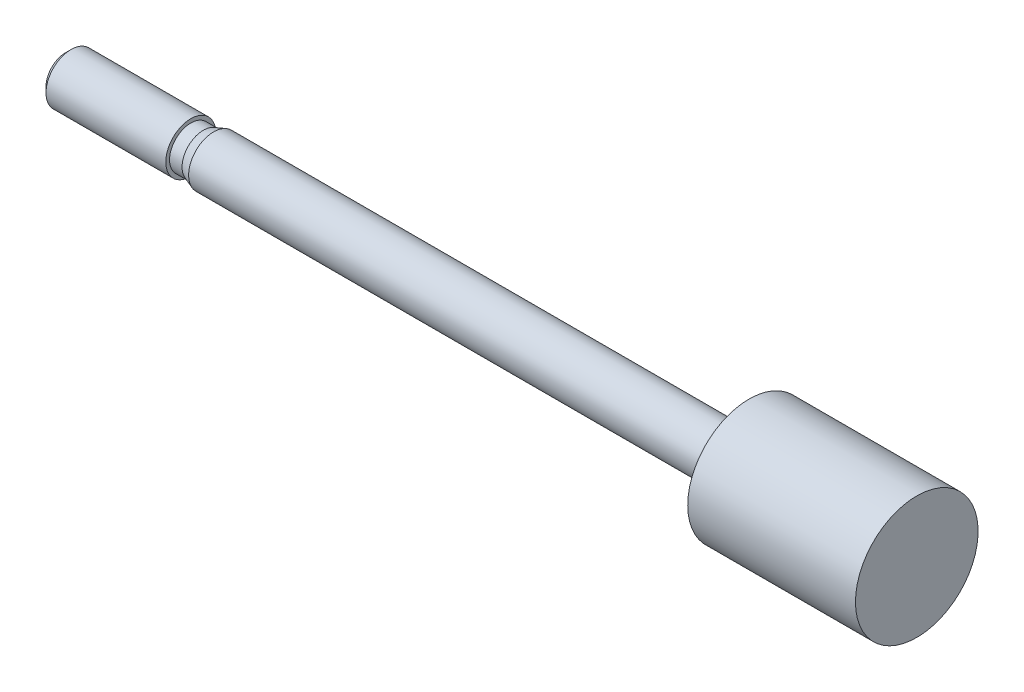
ISO-10303-21;
HEADER;
FILE_DESCRIPTION(('STEP AP214'),'2;1');
FILE_NAME('part.step','',(''),(''),'','','');
FILE_SCHEMA(('AUTOMOTIVE_DESIGN { 1 0 10303 214 1 1 1 1 }'));
ENDSEC;
DATA;
#1=APPLICATION_CONTEXT('core data for automotive mechanical design processes');
#2=APPLICATION_PROTOCOL_DEFINITION('international standard','automotive_design',2000,#1);
#3=PRODUCT_CONTEXT('',#1,'mechanical');
#4=PRODUCT('Part','Part','',(#3));
#5=PRODUCT_RELATED_PRODUCT_CATEGORY('part','',(#4));
#6=PRODUCT_DEFINITION_FORMATION('','',#4);
#7=PRODUCT_DEFINITION_CONTEXT('part definition',#1,'design');
#8=PRODUCT_DEFINITION('design','',#6,#7);
#9=PRODUCT_DEFINITION_SHAPE('','',#8);
#10=(LENGTH_UNIT() NAMED_UNIT(*) SI_UNIT(.MILLI.,.METRE.));
#11=(NAMED_UNIT(*) PLANE_ANGLE_UNIT() SI_UNIT($,.RADIAN.));
#12=(NAMED_UNIT(*) SI_UNIT($,.STERADIAN.) SOLID_ANGLE_UNIT());
#13=UNCERTAINTY_MEASURE_WITH_UNIT(LENGTH_MEASURE(1.E-05),#10,'distance_accuracy_value','');
#14=(GEOMETRIC_REPRESENTATION_CONTEXT(3) GLOBAL_UNCERTAINTY_ASSIGNED_CONTEXT((#13)) GLOBAL_UNIT_ASSIGNED_CONTEXT((#10,
#11,#12)) REPRESENTATION_CONTEXT('',''));
#15=CARTESIAN_POINT('',(0.,0.,0.));
#16=DIRECTION('',(0.,0.,1.));
#17=DIRECTION('',(1.,0.,0.));
#18=AXIS2_PLACEMENT_3D('',#15,#16,#17);
#19=CARTESIAN_POINT('',(-16.,0.,0.));
#20=DIRECTION('',(1.,0.,0.));
#21=DIRECTION('',(0.,0.,-1.));
#22=AXIS2_PLACEMENT_3D('',#19,#20,#21);
#23=PLANE('',#22);
#24=CARTESIAN_POINT('',(-16.,0.,0.));
#25=DIRECTION('',(-1.,0.,0.));
#26=DIRECTION('',(0.,0.,1.));
#27=AXIS2_PLACEMENT_3D('',#24,#25,#26);
#28=CIRCLE('',#27,1.5705);
#29=CARTESIAN_POINT('',(-16.,0.,1.5705));
#30=VERTEX_POINT('',#29);
#31=EDGE_CURVE('E10',#30,#30,#28,.T.);
#32=ORIENTED_EDGE('',*,*,#31,.T.);
#33=EDGE_LOOP('',(#32));
#34=FACE_BOUND('',#33,.T.);
#35=ADVANCED_FACE('F14',(#34),#23,.F.);
#36=CARTESIAN_POINT('',(-15.5705,0.,0.));
#37=DIRECTION('',(1.,0.,0.));
#38=DIRECTION('',(0.,0.,-1.));
#39=AXIS2_PLACEMENT_3D('',#36,#37,#38);
#40=CONICAL_SURFACE('',#39,2.,0.785398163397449);
#41=ORIENTED_EDGE('',*,*,#31,.F.);
#42=EDGE_LOOP('',(#41));
#43=FACE_BOUND('',#42,.T.);
#44=CARTESIAN_POINT('',(-15.5705,0.,0.));
#45=DIRECTION('',(-1.,0.,0.));
#46=DIRECTION('',(0.,0.,1.));
#47=AXIS2_PLACEMENT_3D('',#44,#45,#46);
#48=CIRCLE('',#47,2.);
#49=CARTESIAN_POINT('',(-15.5705,0.,2.));
#50=VERTEX_POINT('',#49);
#51=EDGE_CURVE('E20',#50,#50,#48,.T.);
#52=ORIENTED_EDGE('',*,*,#51,.T.);
#53=EDGE_LOOP('',(#52));
#54=FACE_BOUND('',#53,.T.);
#55=ADVANCED_FACE('F63',(#43,#54),#40,.T.);
#56=CARTESIAN_POINT('',(52.,0.,0.));
#57=DIRECTION('',(-1.,0.,0.));
#58=DIRECTION('',(0.,0.,1.));
#59=AXIS2_PLACEMENT_3D('',#56,#57,#58);
#60=CYLINDRICAL_SURFACE('',#59,2.);
#61=ORIENTED_EDGE('',*,*,#51,.F.);
#62=EDGE_LOOP('',(#61));
#63=FACE_BOUND('',#62,.T.);
#64=CARTESIAN_POINT('',(-6.,0.,0.));
#65=DIRECTION('',(-1.,0.,0.));
#66=DIRECTION('',(0.,0.,1.));
#67=AXIS2_PLACEMENT_3D('',#64,#65,#66);
#68=CIRCLE('',#67,2.);
#69=CARTESIAN_POINT('',(-6.,0.,2.));
#70=VERTEX_POINT('',#69);
#71=EDGE_CURVE('E24',#70,#70,#68,.T.);
#72=ORIENTED_EDGE('',*,*,#71,.T.);
#73=EDGE_LOOP('',(#72));
#74=FACE_BOUND('',#73,.T.);
#75=ADVANCED_FACE('F68',(#63,#74),#60,.T.);
#76=CARTESIAN_POINT('',(-6.,2.,0.));
#77=DIRECTION('',(-1.,0.,0.));
#78=DIRECTION('',(0.,0.,1.));
#79=AXIS2_PLACEMENT_3D('',#76,#77,#78);
#80=PLANE('',#79);
#81=ORIENTED_EDGE('',*,*,#71,.F.);
#82=EDGE_LOOP('',(#81));
#83=FACE_BOUND('',#82,.T.);
#84=CARTESIAN_POINT('',(-6.,0.,0.));
#85=DIRECTION('',(-1.,0.,0.));
#86=DIRECTION('',(0.,0.,1.));
#87=AXIS2_PLACEMENT_3D('',#84,#85,#86);
#88=CIRCLE('',#87,1.7);
#89=CARTESIAN_POINT('',(-6.,0.,1.7));
#90=VERTEX_POINT('',#89);
#91=EDGE_CURVE('E28',#90,#90,#88,.T.);
#92=ORIENTED_EDGE('',*,*,#91,.T.);
#93=EDGE_LOOP('',(#92));
#94=FACE_BOUND('',#93,.T.);
#95=ADVANCED_FACE('F75',(#83,#94),#80,.F.);
#96=CARTESIAN_POINT('',(52.,0.,0.));
#97=DIRECTION('',(-1.,0.,0.));
#98=DIRECTION('',(0.,0.,1.));
#99=AXIS2_PLACEMENT_3D('',#96,#97,#98);
#100=CYLINDRICAL_SURFACE('',#99,1.7);
#101=ORIENTED_EDGE('',*,*,#91,.F.);
#102=EDGE_LOOP('',(#101));
#103=FACE_BOUND('',#102,.T.);
#104=CARTESIAN_POINT('',(-5.,0.,0.));
#105=DIRECTION('',(-1.,0.,0.));
#106=DIRECTION('',(0.,0.,1.));
#107=AXIS2_PLACEMENT_3D('',#104,#105,#106);
#108=CIRCLE('',#107,1.7);
#109=CARTESIAN_POINT('',(-5.,0.,1.7));
#110=VERTEX_POINT('',#109);
#111=EDGE_CURVE('E33',#110,#110,#108,.T.);
#112=ORIENTED_EDGE('',*,*,#111,.T.);
#113=EDGE_LOOP('',(#112));
#114=FACE_BOUND('',#113,.T.);
#115=ADVANCED_FACE('F81',(#103,#114),#100,.T.);
#116=CARTESIAN_POINT('',(-4.17575677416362,0.,0.));
#117=DIRECTION('',(1.,0.,0.));
#118=DIRECTION('',(0.,0.,-1.));
#119=AXIS2_PLACEMENT_3D('',#116,#117,#118);
#120=CONICAL_SURFACE('',#119,2.,0.349065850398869);
#121=ORIENTED_EDGE('',*,*,#111,.F.);
#122=EDGE_LOOP('',(#121));
#123=FACE_BOUND('',#122,.T.);
#124=CARTESIAN_POINT('',(-4.17575677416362,0.,0.));
#125=DIRECTION('',(-1.,0.,0.));
#126=DIRECTION('',(0.,0.,1.));
#127=AXIS2_PLACEMENT_3D('',#124,#125,#126);
#128=CIRCLE('',#127,2.);
#129=CARTESIAN_POINT('',(-4.17575677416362,0.,2.));
#130=VERTEX_POINT('',#129);
#131=EDGE_CURVE('E36',#130,#130,#128,.T.);
#132=ORIENTED_EDGE('',*,*,#131,.T.);
#133=EDGE_LOOP('',(#132));
#134=FACE_BOUND('',#133,.T.);
#135=ADVANCED_FACE('F85',(#123,#134),#120,.T.);
#136=CARTESIAN_POINT('',(52.,0.,0.));
#137=DIRECTION('',(-1.,0.,0.));
#138=DIRECTION('',(0.,0.,1.));
#139=AXIS2_PLACEMENT_3D('',#136,#137,#138);
#140=CYLINDRICAL_SURFACE('',#139,2.);
#141=ORIENTED_EDGE('',*,*,#131,.F.);
#142=EDGE_LOOP('',(#141));
#143=FACE_BOUND('',#142,.T.);
#144=CARTESIAN_POINT('',(38.6,0.,0.));
#145=DIRECTION('',(-1.,0.,0.));
#146=DIRECTION('',(0.,0.,1.));
#147=AXIS2_PLACEMENT_3D('',#144,#145,#146);
#148=CIRCLE('',#147,2.);
#149=CARTESIAN_POINT('',(38.6,0.,2.));
#150=VERTEX_POINT('',#149);
#151=EDGE_CURVE('E39',#150,#150,#148,.T.);
#152=ORIENTED_EDGE('',*,*,#151,.T.);
#153=EDGE_LOOP('',(#152));
#154=FACE_BOUND('',#153,.T.);
#155=ADVANCED_FACE('F89',(#143,#154),#140,.T.);
#156=CARTESIAN_POINT('',(38.6,2.,0.));
#157=DIRECTION('',(1.,0.,0.));
#158=DIRECTION('',(0.,0.,-1.));
#159=AXIS2_PLACEMENT_3D('',#156,#157,#158);
#160=PLANE('',#159);
#161=ORIENTED_EDGE('',*,*,#151,.F.);
#162=EDGE_LOOP('',(#161));
#163=FACE_BOUND('',#162,.T.);
#164=CARTESIAN_POINT('',(38.6,0.,0.));
#165=DIRECTION('',(-1.,0.,0.));
#166=DIRECTION('',(0.,0.,1.));
#167=AXIS2_PLACEMENT_3D('',#164,#165,#166);
#168=CIRCLE('',#167,4.9);
#169=CARTESIAN_POINT('',(38.6,0.,4.9));
#170=VERTEX_POINT('',#169);
#171=EDGE_CURVE('E42',#170,#170,#168,.T.);
#172=ORIENTED_EDGE('',*,*,#171,.T.);
#173=EDGE_LOOP('',(#172));
#174=FACE_BOUND('',#173,.T.);
#175=ADVANCED_FACE('F59',(#163,#174),#160,.F.);
#176=CARTESIAN_POINT('',(52.,0.,0.));
#177=DIRECTION('',(-1.,0.,0.));
#178=DIRECTION('',(0.,0.,1.));
#179=AXIS2_PLACEMENT_3D('',#176,#177,#178);
#180=CYLINDRICAL_SURFACE('',#179,4.9);
#181=ORIENTED_EDGE('',*,*,#171,.F.);
#182=EDGE_LOOP('',(#181));
#183=FACE_BOUND('',#182,.T.);
#184=CARTESIAN_POINT('',(52.,0.,0.));
#185=DIRECTION('',(-1.,0.,0.));
#186=DIRECTION('',(0.,0.,1.));
#187=AXIS2_PLACEMENT_3D('',#184,#185,#186);
#188=CIRCLE('',#187,4.9);
#189=CARTESIAN_POINT('',(52.,0.,4.9));
#190=VERTEX_POINT('',#189);
#191=EDGE_CURVE('E45',#190,#190,#188,.T.);
#192=ORIENTED_EDGE('',*,*,#191,.T.);
#193=EDGE_LOOP('',(#192));
#194=FACE_BOUND('',#193,.T.);
#195=ADVANCED_FACE('F49',(#183,#194),#180,.T.);
#196=CARTESIAN_POINT('',(52.,4.9,0.));
#197=DIRECTION('',(-1.,0.,0.));
#198=DIRECTION('',(0.,0.,1.));
#199=AXIS2_PLACEMENT_3D('',#196,#197,#198);
#200=PLANE('',#199);
#201=ORIENTED_EDGE('',*,*,#191,.F.);
#202=EDGE_LOOP('',(#201));
#203=FACE_BOUND('',#202,.T.);
#204=ADVANCED_FACE('F51',(#203),#200,.F.);
#205=CLOSED_SHELL('',(#35,#55,#75,#95,#115,#135,#155,#175,#195,#204));
#206=MANIFOLD_SOLID_BREP('B1',#205);
#207=ADVANCED_BREP_SHAPE_REPRESENTATION('',(#18,#206),#14);
#208=SHAPE_DEFINITION_REPRESENTATION(#9,#207);
ENDSEC;
END-ISO-10303-21;
